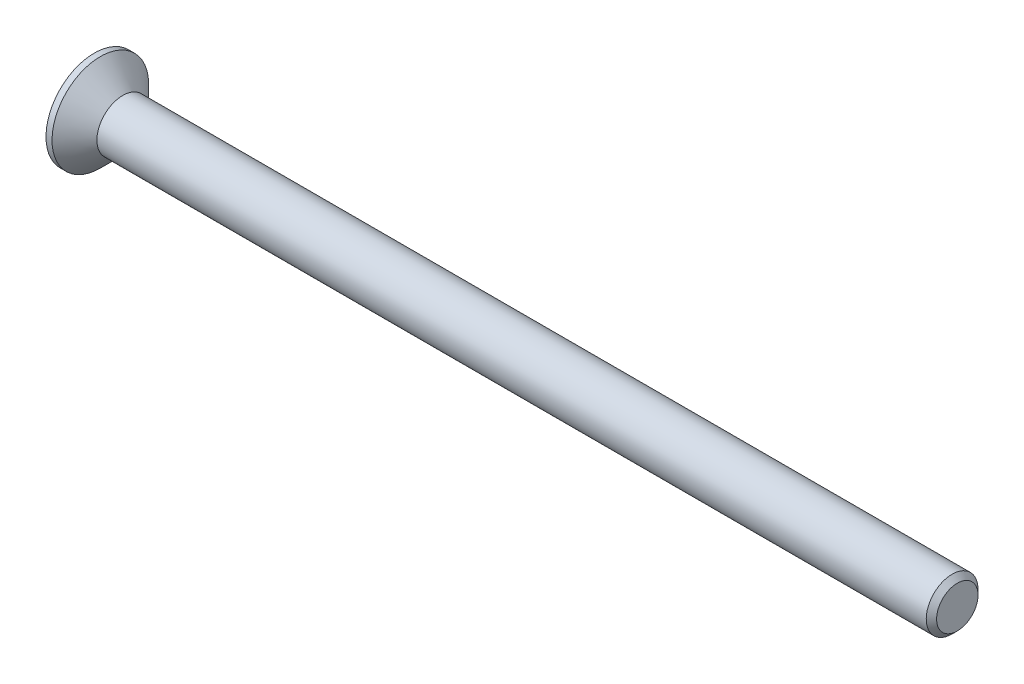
ISO-10303-21;
HEADER;
FILE_DESCRIPTION(('STEP AP214'),'2;1');
FILE_NAME('part.step','',(''),(''),'','','');
FILE_SCHEMA(('AUTOMOTIVE_DESIGN { 1 0 10303 214 1 1 1 1 }'));
ENDSEC;
DATA;
#1=APPLICATION_CONTEXT('core data for automotive mechanical design processes');
#2=APPLICATION_PROTOCOL_DEFINITION('international standard','automotive_design',2000,#1);
#3=PRODUCT_CONTEXT('',#1,'mechanical');
#4=PRODUCT('Part','Part','',(#3));
#5=PRODUCT_RELATED_PRODUCT_CATEGORY('part','',(#4));
#6=PRODUCT_DEFINITION_FORMATION('','',#4);
#7=PRODUCT_DEFINITION_CONTEXT('part definition',#1,'design');
#8=PRODUCT_DEFINITION('design','',#6,#7);
#9=PRODUCT_DEFINITION_SHAPE('','',#8);
#10=(LENGTH_UNIT() NAMED_UNIT(*) SI_UNIT(.MILLI.,.METRE.));
#11=(NAMED_UNIT(*) PLANE_ANGLE_UNIT() SI_UNIT($,.RADIAN.));
#12=(NAMED_UNIT(*) SI_UNIT($,.STERADIAN.) SOLID_ANGLE_UNIT());
#13=UNCERTAINTY_MEASURE_WITH_UNIT(LENGTH_MEASURE(1.E-05),#10,'distance_accuracy_value','');
#14=(GEOMETRIC_REPRESENTATION_CONTEXT(3) GLOBAL_UNCERTAINTY_ASSIGNED_CONTEXT((#13)) GLOBAL_UNIT_ASSIGNED_CONTEXT((#10,
#11,#12)) REPRESENTATION_CONTEXT('',''));
#15=CARTESIAN_POINT('',(0.,0.,0.));
#16=DIRECTION('',(0.,0.,1.));
#17=DIRECTION('',(1.,0.,0.));
#18=AXIS2_PLACEMENT_3D('',#15,#16,#17);
#19=CARTESIAN_POINT('',(0.,0.,0.));
#20=DIRECTION('',(-1.,0.,0.));
#21=DIRECTION('',(0.,-1.,0.));
#22=AXIS2_PLACEMENT_3D('',#19,#20,#21);
#23=CONICAL_SURFACE('',#22,1.5,0.78539816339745);
#24=CARTESIAN_POINT('',(-1.3,0.,0.));
#25=DIRECTION('',(-1.,0.,0.));
#26=DIRECTION('',(0.,-1.,0.));
#27=AXIS2_PLACEMENT_3D('',#24,#25,#26);
#28=CIRCLE('',#27,2.8);
#29=CARTESIAN_POINT('',(-1.3,-2.8,0.));
#30=VERTEX_POINT('',#29);
#31=EDGE_CURVE('E189',#30,#30,#28,.T.);
#32=ORIENTED_EDGE('',*,*,#31,.F.);
#33=EDGE_LOOP('',(#32));
#34=FACE_BOUND('',#33,.T.);
#35=CARTESIAN_POINT('',(0.,0.,0.));
#36=DIRECTION('',(-1.,0.,0.));
#37=DIRECTION('',(0.,-1.,0.));
#38=AXIS2_PLACEMENT_3D('',#35,#36,#37);
#39=CIRCLE('',#38,1.5);
#40=CARTESIAN_POINT('',(0.,-1.5,0.));
#41=VERTEX_POINT('',#40);
#42=EDGE_CURVE('E212',#41,#41,#39,.T.);
#43=ORIENTED_EDGE('',*,*,#42,.T.);
#44=EDGE_LOOP('',(#43));
#45=FACE_BOUND('',#44,.T.);
#46=ADVANCED_FACE('F33',(#34,#45),#23,.T.);
#47=CARTESIAN_POINT('',(-1.65,0.,0.));
#48=DIRECTION('',(-1.,0.,0.));
#49=DIRECTION('',(0.,-1.,0.));
#50=AXIS2_PLACEMENT_3D('',#47,#48,#49);
#51=CYLINDRICAL_SURFACE('',#50,1.5);
#52=CARTESIAN_POINT('',(48.05,0.,0.));
#53=DIRECTION('',(-1.,0.,0.));
#54=DIRECTION('',(0.,-1.,0.));
#55=AXIS2_PLACEMENT_3D('',#52,#53,#54);
#56=CIRCLE('',#55,1.5);
#57=CARTESIAN_POINT('',(48.05,-1.5,0.));
#58=VERTEX_POINT('',#57);
#59=EDGE_CURVE('E41',#58,#58,#56,.T.);
#60=ORIENTED_EDGE('',*,*,#59,.T.);
#61=EDGE_LOOP('',(#60));
#62=FACE_BOUND('',#61,.T.);
#63=ORIENTED_EDGE('',*,*,#42,.F.);
#64=EDGE_LOOP('',(#63));
#65=FACE_BOUND('',#64,.T.);
#66=ADVANCED_FACE('F217',(#62,#65),#51,.T.);
#67=CARTESIAN_POINT('',(48.35,0.,0.));
#68=DIRECTION('',(-1.,0.,0.));
#69=DIRECTION('',(0.,-1.,0.));
#70=AXIS2_PLACEMENT_3D('',#67,#68,#69);
#71=PLANE('',#70);
#72=CARTESIAN_POINT('',(48.35,0.,0.));
#73=DIRECTION('',(-1.,0.,0.));
#74=DIRECTION('',(0.,-1.,0.));
#75=AXIS2_PLACEMENT_3D('',#72,#73,#74);
#76=CIRCLE('',#75,1.20000000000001);
#77=CARTESIAN_POINT('',(48.35,-1.20000000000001,0.));
#78=VERTEX_POINT('',#77);
#79=EDGE_CURVE('E11',#78,#78,#76,.F.);
#80=ORIENTED_EDGE('',*,*,#79,.T.);
#81=EDGE_LOOP('',(#80));
#82=FACE_BOUND('',#81,.T.);
#83=ADVANCED_FACE('F239',(#82),#71,.F.);
#84=CARTESIAN_POINT('',(-1.65,2.8,0.));
#85=DIRECTION('',(1.,0.,0.));
#86=DIRECTION('',(0.,1.,0.));
#87=AXIS2_PLACEMENT_3D('',#84,#85,#86);
#88=PLANE('',#87);
#89=DIRECTION('',(0.,0.,-1.));
#90=VECTOR('',#89,1.);
#91=CARTESIAN_POINT('',(-1.65,0.365,-1.45));
#92=LINE('',#91,#90);
#93=CARTESIAN_POINT('',(-1.65,0.365,-0.365));
#94=VERTEX_POINT('',#93);
#95=CARTESIAN_POINT('',(-1.65,0.365,-1.45));
#96=VERTEX_POINT('',#95);
#97=EDGE_CURVE('E158',#94,#96,#92,.T.);
#98=ORIENTED_EDGE('',*,*,#97,.F.);
#99=DIRECTION('',(0.,-1.,0.));
#100=VECTOR('',#99,1.);
#101=CARTESIAN_POINT('',(-1.65,0.365,-0.365));
#102=LINE('',#101,#100);
#103=CARTESIAN_POINT('',(-1.65,1.45,-0.365));
#104=VERTEX_POINT('',#103);
#105=EDGE_CURVE('E48',#104,#94,#102,.T.);
#106=ORIENTED_EDGE('',*,*,#105,.F.);
#107=DIRECTION('',(0.,0.,-1.));
#108=VECTOR('',#107,1.);
#109=CARTESIAN_POINT('',(-1.65,1.45,-0.365));
#110=LINE('',#109,#108);
#111=CARTESIAN_POINT('',(-1.65,1.45,0.365));
#112=VERTEX_POINT('',#111);
#113=EDGE_CURVE('E185',#112,#104,#110,.T.);
#114=ORIENTED_EDGE('',*,*,#113,.F.);
#115=DIRECTION('',(0.,1.,0.));
#116=VECTOR('',#115,1.);
#117=CARTESIAN_POINT('',(-1.65,1.45,0.365));
#118=LINE('',#117,#116);
#119=CARTESIAN_POINT('',(-1.65,0.365,0.365));
#120=VERTEX_POINT('',#119);
#121=EDGE_CURVE('E183',#120,#112,#118,.T.);
#122=ORIENTED_EDGE('',*,*,#121,.F.);
#123=DIRECTION('',(0.,0.,-1.));
#124=VECTOR('',#123,1.);
#125=CARTESIAN_POINT('',(-1.65,0.365,0.365));
#126=LINE('',#125,#124);
#127=CARTESIAN_POINT('',(-1.65,0.365,1.45));
#128=VERTEX_POINT('',#127);
#129=EDGE_CURVE('E132',#128,#120,#126,.T.);
#130=ORIENTED_EDGE('',*,*,#129,.F.);
#131=DIRECTION('',(0.,1.,0.));
#132=VECTOR('',#131,1.);
#133=CARTESIAN_POINT('',(-1.65,0.365,1.45));
#134=LINE('',#133,#132);
#135=CARTESIAN_POINT('',(-1.65,-0.365,1.45));
#136=VERTEX_POINT('',#135);
#137=EDGE_CURVE('E179',#136,#128,#134,.T.);
#138=ORIENTED_EDGE('',*,*,#137,.F.);
#139=DIRECTION('',(0.,0.,1.));
#140=VECTOR('',#139,1.);
#141=CARTESIAN_POINT('',(-1.65,-0.365,1.45));
#142=LINE('',#141,#140);
#143=CARTESIAN_POINT('',(-1.65,-0.365,0.365));
#144=VERTEX_POINT('',#143);
#145=EDGE_CURVE('E176',#144,#136,#142,.T.);
#146=ORIENTED_EDGE('',*,*,#145,.F.);
#147=DIRECTION('',(0.,1.,0.));
#148=VECTOR('',#147,1.);
#149=CARTESIAN_POINT('',(-1.65,-0.365,0.365));
#150=LINE('',#149,#148);
#151=CARTESIAN_POINT('',(-1.65,-1.45,0.365));
#152=VERTEX_POINT('',#151);
#153=EDGE_CURVE('E173',#152,#144,#150,.T.);
#154=ORIENTED_EDGE('',*,*,#153,.F.);
#155=DIRECTION('',(0.,0.,1.));
#156=VECTOR('',#155,1.);
#157=CARTESIAN_POINT('',(-1.65,-1.45,0.365));
#158=LINE('',#157,#156);
#159=CARTESIAN_POINT('',(-1.65,-1.45,-0.365));
#160=VERTEX_POINT('',#159);
#161=EDGE_CURVE('E170',#160,#152,#158,.T.);
#162=ORIENTED_EDGE('',*,*,#161,.F.);
#163=DIRECTION('',(0.,-1.,0.));
#164=VECTOR('',#163,1.);
#165=CARTESIAN_POINT('',(-1.65,-1.45,-0.365));
#166=LINE('',#165,#164);
#167=CARTESIAN_POINT('',(-1.65,-0.365,-0.365));
#168=VERTEX_POINT('',#167);
#169=EDGE_CURVE('E167',#168,#160,#166,.T.);
#170=ORIENTED_EDGE('',*,*,#169,.F.);
#171=DIRECTION('',(0.,0.,1.));
#172=VECTOR('',#171,1.);
#173=CARTESIAN_POINT('',(-1.65,-0.365,-0.365));
#174=LINE('',#173,#172);
#175=CARTESIAN_POINT('',(-1.65,-0.365,-1.45));
#176=VERTEX_POINT('',#175);
#177=EDGE_CURVE('E164',#176,#168,#174,.T.);
#178=ORIENTED_EDGE('',*,*,#177,.F.);
#179=DIRECTION('',(0.,-1.,0.));
#180=VECTOR('',#179,1.);
#181=CARTESIAN_POINT('',(-1.65,-0.365,-1.45));
#182=LINE('',#181,#180);
#183=EDGE_CURVE('E161',#96,#176,#182,.T.);
#184=ORIENTED_EDGE('',*,*,#183,.F.);
#185=EDGE_LOOP('',(#98,#106,#114,#122,#130,#138,#146,#154,#162,#170,#178,#184));
#186=FACE_BOUND('',#185,.T.);
#187=CARTESIAN_POINT('',(-1.65,0.,0.));
#188=DIRECTION('',(-1.,0.,0.));
#189=DIRECTION('',(0.,-1.,0.));
#190=AXIS2_PLACEMENT_3D('',#187,#188,#189);
#191=CIRCLE('',#190,2.8);
#192=CARTESIAN_POINT('',(-1.65,-2.8,0.));
#193=VERTEX_POINT('',#192);
#194=EDGE_CURVE('E209',#193,#193,#191,.T.);
#195=ORIENTED_EDGE('',*,*,#194,.T.);
#196=EDGE_LOOP('',(#195));
#197=FACE_BOUND('',#196,.T.);
#198=ADVANCED_FACE('F230',(#186,#197),#88,.F.);
#199=CARTESIAN_POINT('',(-1.65,0.,0.));
#200=DIRECTION('',(-1.,0.,0.));
#201=DIRECTION('',(0.,-1.,0.));
#202=AXIS2_PLACEMENT_3D('',#199,#200,#201);
#203=CYLINDRICAL_SURFACE('',#202,2.8);
#204=ORIENTED_EDGE('',*,*,#194,.F.);
#205=EDGE_LOOP('',(#204));
#206=FACE_BOUND('',#205,.T.);
#207=ORIENTED_EDGE('',*,*,#31,.T.);
#208=EDGE_LOOP('',(#207));
#209=FACE_BOUND('',#208,.T.);
#210=ADVANCED_FACE('F222',(#206,#209),#203,.T.);
#211=CARTESIAN_POINT('',(48.05,0.,0.));
#212=DIRECTION('',(-1.,0.,0.));
#213=DIRECTION('',(0.,-1.,0.));
#214=AXIS2_PLACEMENT_3D('',#211,#212,#213);
#215=CONICAL_SURFACE('',#214,1.5,0.785398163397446);
#216=ORIENTED_EDGE('',*,*,#79,.F.);
#217=EDGE_LOOP('',(#216));
#218=FACE_BOUND('',#217,.T.);
#219=ORIENTED_EDGE('',*,*,#59,.F.);
#220=EDGE_LOOP('',(#219));
#221=FACE_BOUND('',#220,.T.);
#222=ADVANCED_FACE('F35',(#218,#221),#215,.T.);
#223=CARTESIAN_POINT('',(-0.4,0.365,-0.365));
#224=DIRECTION('',(0.,0.,-1.));
#225=DIRECTION('',(-1.,0.,0.));
#226=AXIS2_PLACEMENT_3D('',#223,#224,#225);
#227=PLANE('',#226);
#228=ORIENTED_EDGE('',*,*,#105,.T.);
#229=DIRECTION('',(-1.,0.,0.));
#230=VECTOR('',#229,1.);
#231=CARTESIAN_POINT('',(-0.4,0.365,-0.365));
#232=LINE('',#231,#230);
#233=CARTESIAN_POINT('',(-0.4,0.365,-0.365));
#234=VERTEX_POINT('',#233);
#235=EDGE_CURVE('E96',#234,#94,#232,.T.);
#236=ORIENTED_EDGE('',*,*,#235,.F.);
#237=DIRECTION('',(0.,-1.,0.));
#238=VECTOR('',#237,1.);
#239=CARTESIAN_POINT('',(-0.4,0.365,-0.365));
#240=LINE('',#239,#238);
#241=CARTESIAN_POINT('',(-0.4,1.45,-0.365));
#242=VERTEX_POINT('',#241);
#243=EDGE_CURVE('E187',#242,#234,#240,.T.);
#244=ORIENTED_EDGE('',*,*,#243,.F.);
#245=DIRECTION('',(-1.,0.,0.));
#246=VECTOR('',#245,1.);
#247=CARTESIAN_POINT('',(-0.4,1.45,-0.365));
#248=LINE('',#247,#246);
#249=EDGE_CURVE('E56',#242,#104,#248,.T.);
#250=ORIENTED_EDGE('',*,*,#249,.T.);
#251=EDGE_LOOP('',(#228,#236,#244,#250));
#252=FACE_BOUND('',#251,.T.);
#253=ADVANCED_FACE('F221',(#252),#227,.F.);
#254=CARTESIAN_POINT('',(-0.4,1.45,-0.365));
#255=DIRECTION('',(0.,1.,0.));
#256=DIRECTION('',(-1.,0.,0.));
#257=AXIS2_PLACEMENT_3D('',#254,#255,#256);
#258=PLANE('',#257);
#259=ORIENTED_EDGE('',*,*,#113,.T.);
#260=ORIENTED_EDGE('',*,*,#249,.F.);
#261=DIRECTION('',(0.,0.,-1.));
#262=VECTOR('',#261,1.);
#263=CARTESIAN_POINT('',(-0.4,1.45,-0.365));
#264=LINE('',#263,#262);
#265=CARTESIAN_POINT('',(-0.4,1.45,0.365));
#266=VERTEX_POINT('',#265);
#267=EDGE_CURVE('E144',#266,#242,#264,.T.);
#268=ORIENTED_EDGE('',*,*,#267,.F.);
#269=DIRECTION('',(-1.,0.,0.));
#270=VECTOR('',#269,1.);
#271=CARTESIAN_POINT('',(-0.4,1.45,0.365));
#272=LINE('',#271,#270);
#273=EDGE_CURVE('E136',#266,#112,#272,.T.);
#274=ORIENTED_EDGE('',*,*,#273,.T.);
#275=EDGE_LOOP('',(#259,#260,#268,#274));
#276=FACE_BOUND('',#275,.T.);
#277=ADVANCED_FACE('F228',(#276),#258,.F.);
#278=CARTESIAN_POINT('',(-0.4,1.45,0.365));
#279=DIRECTION('',(0.,0.,1.));
#280=DIRECTION('',(1.,0.,0.));
#281=AXIS2_PLACEMENT_3D('',#278,#279,#280);
#282=PLANE('',#281);
#283=ORIENTED_EDGE('',*,*,#121,.T.);
#284=ORIENTED_EDGE('',*,*,#273,.F.);
#285=DIRECTION('',(0.,1.,0.));
#286=VECTOR('',#285,1.);
#287=CARTESIAN_POINT('',(-0.4,1.45,0.365));
#288=LINE('',#287,#286);
#289=CARTESIAN_POINT('',(-0.4,0.365,0.365));
#290=VERTEX_POINT('',#289);
#291=EDGE_CURVE('E140',#290,#266,#288,.T.);
#292=ORIENTED_EDGE('',*,*,#291,.F.);
#293=DIRECTION('',(-1.,0.,0.));
#294=VECTOR('',#293,1.);
#295=CARTESIAN_POINT('',(-0.4,0.365,0.365));
#296=LINE('',#295,#294);
#297=EDGE_CURVE('E125',#290,#120,#296,.T.);
#298=ORIENTED_EDGE('',*,*,#297,.T.);
#299=EDGE_LOOP('',(#283,#284,#292,#298));
#300=FACE_BOUND('',#299,.T.);
#301=ADVANCED_FACE('F141',(#300),#282,.F.);
#302=CARTESIAN_POINT('',(-0.4,0.365,0.365));
#303=DIRECTION('',(0.,1.,0.));
#304=DIRECTION('',(-1.,0.,0.));
#305=AXIS2_PLACEMENT_3D('',#302,#303,#304);
#306=PLANE('',#305);
#307=ORIENTED_EDGE('',*,*,#129,.T.);
#308=ORIENTED_EDGE('',*,*,#297,.F.);
#309=DIRECTION('',(0.,0.,-1.));
#310=VECTOR('',#309,1.);
#311=CARTESIAN_POINT('',(-0.4,0.365,0.365));
#312=LINE('',#311,#310);
#313=CARTESIAN_POINT('',(-0.4,0.365,1.45));
#314=VERTEX_POINT('',#313);
#315=EDGE_CURVE('E129',#314,#290,#312,.T.);
#316=ORIENTED_EDGE('',*,*,#315,.F.);
#317=DIRECTION('',(-1.,0.,0.));
#318=VECTOR('',#317,1.);
#319=CARTESIAN_POINT('',(-0.4,0.365,1.45));
#320=LINE('',#319,#318);
#321=EDGE_CURVE('E137',#314,#128,#320,.T.);
#322=ORIENTED_EDGE('',*,*,#321,.T.);
#323=EDGE_LOOP('',(#307,#308,#316,#322));
#324=FACE_BOUND('',#323,.T.);
#325=ADVANCED_FACE('F127',(#324),#306,.F.);
#326=CARTESIAN_POINT('',(-0.4,0.365,1.45));
#327=DIRECTION('',(0.,0.,1.));
#328=DIRECTION('',(1.,0.,0.));
#329=AXIS2_PLACEMENT_3D('',#326,#327,#328);
#330=PLANE('',#329);
#331=ORIENTED_EDGE('',*,*,#137,.T.);
#332=ORIENTED_EDGE('',*,*,#321,.F.);
#333=DIRECTION('',(0.,1.,0.));
#334=VECTOR('',#333,1.);
#335=CARTESIAN_POINT('',(-0.4,0.365,1.45));
#336=LINE('',#335,#334);
#337=CARTESIAN_POINT('',(-0.4,-0.365,1.45));
#338=VERTEX_POINT('',#337);
#339=EDGE_CURVE('E150',#338,#314,#336,.T.);
#340=ORIENTED_EDGE('',*,*,#339,.F.);
#341=DIRECTION('',(-1.,0.,0.));
#342=VECTOR('',#341,1.);
#343=CARTESIAN_POINT('',(-0.4,-0.365,1.45));
#344=LINE('',#343,#342);
#345=EDGE_CURVE('E192',#338,#136,#344,.T.);
#346=ORIENTED_EDGE('',*,*,#345,.T.);
#347=EDGE_LOOP('',(#331,#332,#340,#346));
#348=FACE_BOUND('',#347,.T.);
#349=ADVANCED_FACE('F277',(#348),#330,.F.);
#350=CARTESIAN_POINT('',(-0.4,-0.365,1.45));
#351=DIRECTION('',(0.,-1.,0.));
#352=DIRECTION('',(1.,0.,0.));
#353=AXIS2_PLACEMENT_3D('',#350,#351,#352);
#354=PLANE('',#353);
#355=ORIENTED_EDGE('',*,*,#145,.T.);
#356=ORIENTED_EDGE('',*,*,#345,.F.);
#357=DIRECTION('',(0.,0.,1.));
#358=VECTOR('',#357,1.);
#359=CARTESIAN_POINT('',(-0.4,-0.365,1.45));
#360=LINE('',#359,#358);
#361=CARTESIAN_POINT('',(-0.4,-0.365,0.365));
#362=VERTEX_POINT('',#361);
#363=EDGE_CURVE('E152',#362,#338,#360,.T.);
#364=ORIENTED_EDGE('',*,*,#363,.F.);
#365=DIRECTION('',(-1.,0.,0.));
#366=VECTOR('',#365,1.);
#367=CARTESIAN_POINT('',(-0.4,-0.365,0.365));
#368=LINE('',#367,#366);
#369=EDGE_CURVE('E194',#362,#144,#368,.T.);
#370=ORIENTED_EDGE('',*,*,#369,.T.);
#371=EDGE_LOOP('',(#355,#356,#364,#370));
#372=FACE_BOUND('',#371,.T.);
#373=ADVANCED_FACE('F273',(#372),#354,.F.);
#374=CARTESIAN_POINT('',(-0.4,-0.365,0.365));
#375=DIRECTION('',(0.,0.,1.));
#376=DIRECTION('',(1.,0.,0.));
#377=AXIS2_PLACEMENT_3D('',#374,#375,#376);
#378=PLANE('',#377);
#379=ORIENTED_EDGE('',*,*,#153,.T.);
#380=ORIENTED_EDGE('',*,*,#369,.F.);
#381=DIRECTION('',(0.,1.,0.));
#382=VECTOR('',#381,1.);
#383=CARTESIAN_POINT('',(-0.4,-0.365,0.365));
#384=LINE('',#383,#382);
#385=CARTESIAN_POINT('',(-0.4,-1.45,0.365));
#386=VERTEX_POINT('',#385);
#387=EDGE_CURVE('E422',#386,#362,#384,.T.);
#388=ORIENTED_EDGE('',*,*,#387,.F.);
#389=DIRECTION('',(-1.,0.,0.));
#390=VECTOR('',#389,1.);
#391=CARTESIAN_POINT('',(-0.4,-1.45,0.365));
#392=LINE('',#391,#390);
#393=EDGE_CURVE('E196',#386,#152,#392,.T.);
#394=ORIENTED_EDGE('',*,*,#393,.T.);
#395=EDGE_LOOP('',(#379,#380,#388,#394));
#396=FACE_BOUND('',#395,.T.);
#397=ADVANCED_FACE('F269',(#396),#378,.F.);
#398=CARTESIAN_POINT('',(-0.4,-1.45,0.365));
#399=DIRECTION('',(0.,-1.,0.));
#400=DIRECTION('',(1.,0.,0.));
#401=AXIS2_PLACEMENT_3D('',#398,#399,#400);
#402=PLANE('',#401);
#403=ORIENTED_EDGE('',*,*,#161,.T.);
#404=ORIENTED_EDGE('',*,*,#393,.F.);
#405=DIRECTION('',(0.,0.,1.));
#406=VECTOR('',#405,1.);
#407=CARTESIAN_POINT('',(-0.4,-1.45,0.365));
#408=LINE('',#407,#406);
#409=CARTESIAN_POINT('',(-0.4,-1.45,-0.365));
#410=VERTEX_POINT('',#409);
#411=EDGE_CURVE('E419',#410,#386,#408,.T.);
#412=ORIENTED_EDGE('',*,*,#411,.F.);
#413=DIRECTION('',(-1.,0.,0.));
#414=VECTOR('',#413,1.);
#415=CARTESIAN_POINT('',(-0.4,-1.45,-0.365));
#416=LINE('',#415,#414);
#417=EDGE_CURVE('E198',#410,#160,#416,.T.);
#418=ORIENTED_EDGE('',*,*,#417,.T.);
#419=EDGE_LOOP('',(#403,#404,#412,#418));
#420=FACE_BOUND('',#419,.T.);
#421=ADVANCED_FACE('F265',(#420),#402,.F.);
#422=CARTESIAN_POINT('',(-0.4,-1.45,-0.365));
#423=DIRECTION('',(0.,0.,-1.));
#424=DIRECTION('',(-1.,0.,0.));
#425=AXIS2_PLACEMENT_3D('',#422,#423,#424);
#426=PLANE('',#425);
#427=ORIENTED_EDGE('',*,*,#169,.T.);
#428=ORIENTED_EDGE('',*,*,#417,.F.);
#429=DIRECTION('',(0.,-1.,0.));
#430=VECTOR('',#429,1.);
#431=CARTESIAN_POINT('',(-0.4,-1.45,-0.365));
#432=LINE('',#431,#430);
#433=CARTESIAN_POINT('',(-0.4,-0.365,-0.365));
#434=VERTEX_POINT('',#433);
#435=EDGE_CURVE('E416',#434,#410,#432,.T.);
#436=ORIENTED_EDGE('',*,*,#435,.F.);
#437=DIRECTION('',(-1.,0.,0.));
#438=VECTOR('',#437,1.);
#439=CARTESIAN_POINT('',(-0.4,-0.365,-0.365));
#440=LINE('',#439,#438);
#441=EDGE_CURVE('E200',#434,#168,#440,.T.);
#442=ORIENTED_EDGE('',*,*,#441,.T.);
#443=EDGE_LOOP('',(#427,#428,#436,#442));
#444=FACE_BOUND('',#443,.T.);
#445=ADVANCED_FACE('F261',(#444),#426,.F.);
#446=CARTESIAN_POINT('',(-0.4,-0.365,-0.365));
#447=DIRECTION('',(0.,-1.,0.));
#448=DIRECTION('',(1.,0.,0.));
#449=AXIS2_PLACEMENT_3D('',#446,#447,#448);
#450=PLANE('',#449);
#451=ORIENTED_EDGE('',*,*,#177,.T.);
#452=ORIENTED_EDGE('',*,*,#441,.F.);
#453=DIRECTION('',(0.,0.,1.));
#454=VECTOR('',#453,1.);
#455=CARTESIAN_POINT('',(-0.4,-0.365,-0.365));
#456=LINE('',#455,#454);
#457=CARTESIAN_POINT('',(-0.4,-0.365,-1.45));
#458=VERTEX_POINT('',#457);
#459=EDGE_CURVE('E413',#458,#434,#456,.T.);
#460=ORIENTED_EDGE('',*,*,#459,.F.);
#461=DIRECTION('',(-1.,0.,0.));
#462=VECTOR('',#461,1.);
#463=CARTESIAN_POINT('',(-0.4,-0.365,-1.45));
#464=LINE('',#463,#462);
#465=EDGE_CURVE('E202',#458,#176,#464,.T.);
#466=ORIENTED_EDGE('',*,*,#465,.T.);
#467=EDGE_LOOP('',(#451,#452,#460,#466));
#468=FACE_BOUND('',#467,.T.);
#469=ADVANCED_FACE('F257',(#468),#450,.F.);
#470=CARTESIAN_POINT('',(-0.4,-0.365,-1.45));
#471=DIRECTION('',(0.,0.,-1.));
#472=DIRECTION('',(-1.,0.,0.));
#473=AXIS2_PLACEMENT_3D('',#470,#471,#472);
#474=PLANE('',#473);
#475=ORIENTED_EDGE('',*,*,#183,.T.);
#476=ORIENTED_EDGE('',*,*,#465,.F.);
#477=DIRECTION('',(0.,-1.,0.));
#478=VECTOR('',#477,1.);
#479=CARTESIAN_POINT('',(-0.4,-0.365,-1.45));
#480=LINE('',#479,#478);
#481=CARTESIAN_POINT('',(-0.4,0.365,-1.45));
#482=VERTEX_POINT('',#481);
#483=EDGE_CURVE('E408',#482,#458,#480,.T.);
#484=ORIENTED_EDGE('',*,*,#483,.F.);
#485=DIRECTION('',(-1.,0.,0.));
#486=VECTOR('',#485,1.);
#487=CARTESIAN_POINT('',(-0.4,0.365,-1.45));
#488=LINE('',#487,#486);
#489=EDGE_CURVE('E204',#482,#96,#488,.T.);
#490=ORIENTED_EDGE('',*,*,#489,.T.);
#491=EDGE_LOOP('',(#475,#476,#484,#490));
#492=FACE_BOUND('',#491,.T.);
#493=ADVANCED_FACE('F253',(#492),#474,.F.);
#494=CARTESIAN_POINT('',(-0.4,0.365,-1.45));
#495=DIRECTION('',(0.,1.,0.));
#496=DIRECTION('',(-1.,0.,0.));
#497=AXIS2_PLACEMENT_3D('',#494,#495,#496);
#498=PLANE('',#497);
#499=ORIENTED_EDGE('',*,*,#97,.T.);
#500=ORIENTED_EDGE('',*,*,#489,.F.);
#501=DIRECTION('',(0.,0.,-1.));
#502=VECTOR('',#501,1.);
#503=CARTESIAN_POINT('',(-0.4,0.365,-1.45));
#504=LINE('',#503,#502);
#505=EDGE_CURVE('E406',#234,#482,#504,.T.);
#506=ORIENTED_EDGE('',*,*,#505,.F.);
#507=ORIENTED_EDGE('',*,*,#235,.T.);
#508=EDGE_LOOP('',(#499,#500,#506,#507));
#509=FACE_BOUND('',#508,.T.);
#510=ADVANCED_FACE('F250',(#509),#498,.F.);
#511=CARTESIAN_POINT('',(-0.4,0.,0.));
#512=DIRECTION('',(1.,0.,0.));
#513=DIRECTION('',(0.,0.,-1.));
#514=AXIS2_PLACEMENT_3D('',#511,#512,#513);
#515=PLANE('',#514);
#516=ORIENTED_EDGE('',*,*,#243,.T.);
#517=ORIENTED_EDGE('',*,*,#505,.T.);
#518=ORIENTED_EDGE('',*,*,#483,.T.);
#519=ORIENTED_EDGE('',*,*,#459,.T.);
#520=ORIENTED_EDGE('',*,*,#435,.T.);
#521=ORIENTED_EDGE('',*,*,#411,.T.);
#522=ORIENTED_EDGE('',*,*,#387,.T.);
#523=ORIENTED_EDGE('',*,*,#363,.T.);
#524=ORIENTED_EDGE('',*,*,#339,.T.);
#525=ORIENTED_EDGE('',*,*,#315,.T.);
#526=ORIENTED_EDGE('',*,*,#291,.T.);
#527=ORIENTED_EDGE('',*,*,#267,.T.);
#528=EDGE_LOOP('',(#516,#517,#518,#519,#520,#521,#522,#523,#524,#525,#526,#527));
#529=FACE_BOUND('',#528,.T.);
#530=ADVANCED_FACE('F147',(#529),#515,.F.);
#531=CLOSED_SHELL('',(#46,#66,#83,#198,#210,#222,#253,#277,#301,#325,#349,#373,#397,#421,#445,
#469,#493,#510,#530));
#532=MANIFOLD_SOLID_BREP('B2',#531);
#533=ADVANCED_BREP_SHAPE_REPRESENTATION('',(#18,#532),#14);
#534=SHAPE_DEFINITION_REPRESENTATION(#9,#533);
ENDSEC;
END-ISO-10303-21;
